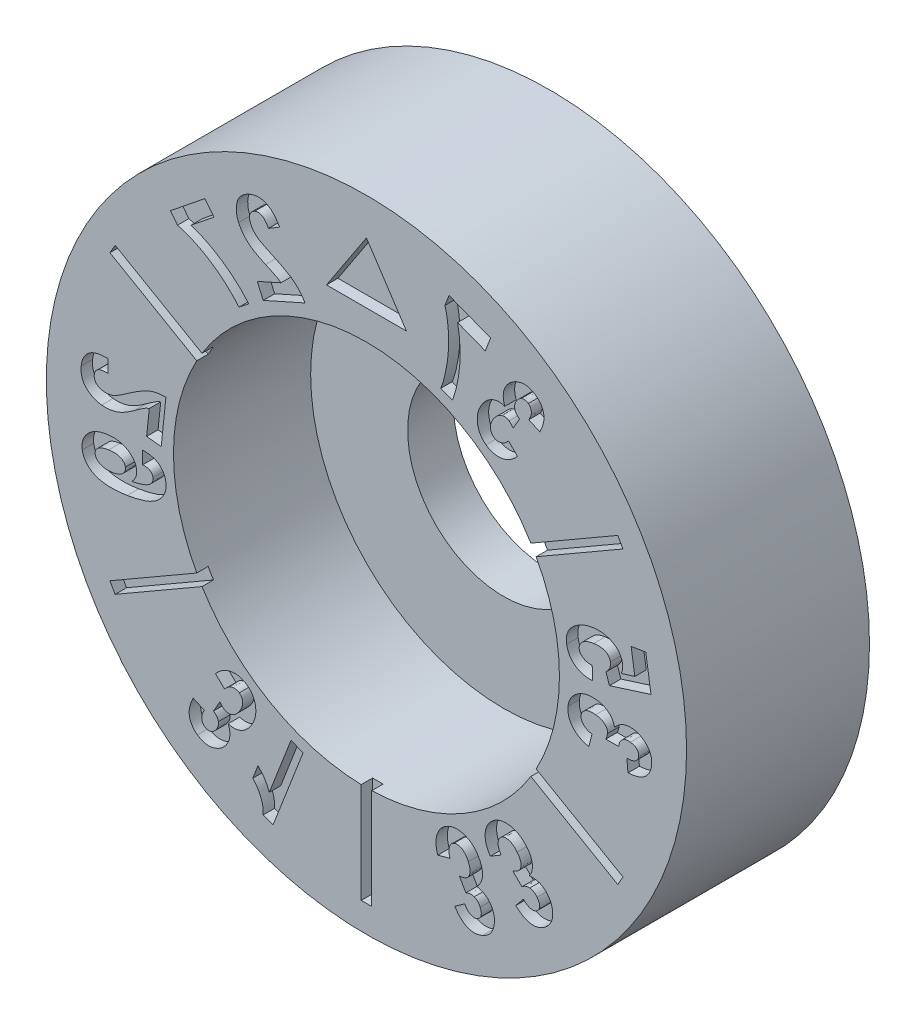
from build123d import *
from build123d.topology import SkipClean

# Parameters (mm, degrees)
SKETCH4_R           = 7
BOSS_EXTRUDE2_DEPTH = 4
SKETCH5_R           = 4.22
CUT_EXTRUDE2_DEPTH  = 3
SKETCH6_R           = 2.1
CUT_EXTRUDE3_DEPTH  = 11.344080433
SKETCH2_W           = 0.23
SKETCH2_H           = 3.311361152
CUT_EXTRUDE1_DEPTH  = 0.25
CUT_EXTRUDE4_DEPTH  = 0.25


with BuildPart() as part:
    # Sketch4 → Boss-Extrude2 (new body)
    with BuildSketch(Plane.XY):
        Circle(SKETCH4_R)
    extrude(amount=-BOSS_EXTRUDE2_DEPTH)

    # Sketch5 → Cut-Extrude2 (cut)
    with BuildSketch(Plane.XY):
        Circle(SKETCH5_R)
    extrude(amount=-CUT_EXTRUDE2_DEPTH, mode=Mode.SUBTRACT)

    # Sketch6 → Cut-Extrude3 (cut, through all)
    with BuildSketch(Plane.XY.offset(-3)):
        Circle(SKETCH6_R)
    extrude(amount=-CUT_EXTRUDE3_DEPTH, mode=Mode.SUBTRACT)

    # Sketch2 → Cut-Extrude1 (cut)
    # profile 1 of 17: a face of its own
    with BuildSketch(Plane.XY):
        with Locations((0, -4.755680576)):
            Rectangle(SKETCH2_W, SKETCH2_H)
    # profile 2 of 17: a face of its own
    with BuildSketch(Plane.XY):
        Polygon((-2.627178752, -1.649592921), (-5.494901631, -3.305273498), (-5.609901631, -3.106087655), (-2.742178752, -1.450407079), align=None)
    # profile 3 of 17: a face of its own
    with BuildSketch(Plane.XY):
        Polygon((-2.742178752, 1.450407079), (-5.609901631, 3.106087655), (-5.494901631, 3.305273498), (-2.627178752, 1.649592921), align=None)
    # profile 4 of 17: a face of its own
    with BuildSketch(Plane.XY):
        Polygon((2.627178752, 1.649592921), (5.494901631, 3.305273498), (5.609901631, 3.106087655), (2.742178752, 1.450407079), align=None)
    # profile 5 of 17: a face of its own
    with BuildSketch(Plane.XY):
        Polygon((2.742178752, -1.450407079), (5.609901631, -3.106087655), (5.494901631, -3.305273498), (2.627178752, -1.649592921), align=None)
    # profile 6 of 17: a face of its own
    with BuildSketch(Plane.XY):
        with BuildLine():
            Line((-2.38861569, 4.17471907), (-2.256937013, 3.880199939))
            Line((-2.256937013, 3.880199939), (-1.344315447, 4.287917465))
            add(Edge.make_bspline(
                [(-1.344315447, 4.287917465), (-1.35986274, 4.314109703), (-1.390802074, 4.366232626), (-1.446032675, 4.438548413), (-1.507471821, 4.505505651), (-1.56439157, 4.557424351), (-1.615671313, 4.596737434), (-1.659918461, 4.62755868), (-1.710098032, 4.659193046), (-1.766149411, 4.691687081), (-1.827747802, 4.72533601), (-1.894948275, 4.76007545), (-1.967894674, 4.795711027), (-2.01885546, 4.81896875), (-2.04516792, 4.830977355)],
                knots=[0, 0, 0, 0, 1.212157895, 2.412211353, 3.615463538, 4.827631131, 5.474319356, 6.187579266, 6.974328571, 7.83585823, 8.767313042, 9.769280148, 10.848217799, 12, 12, 12, 12], degree=3))
            add(Edge.make_bspline(
                [(-2.04516792, 4.830977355), (-2.065792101, 4.840420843), (-2.10512067, 4.858428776), (-2.160967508, 4.885057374), (-2.210959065, 4.909340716), (-2.25510831, 4.931547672), (-2.293110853, 4.952001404), (-2.325378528, 4.970194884), (-2.352057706, 4.985772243), (-2.367240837, 4.996392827), (-2.373987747, 5.001112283)],
                knots=[0, 0, 0, 0, 1.468863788, 2.80099903, 4.006361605, 5.067811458, 6.000988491, 6.800569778, 7.467010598, 8, 8, 8, 8], degree=3))
            add(Edge.make_bspline(
                [(-2.373987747, 5.001112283), (-2.390475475, 5.013720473), (-2.422592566, 5.038280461), (-2.463775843, 5.081130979), (-2.498548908, 5.12672587), (-2.515139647, 5.16034811), (-2.523354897, 5.176996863)],
                knots=[0, 0, 0, 0, 1.065813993, 2.076140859, 3.047360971, 4, 4, 4, 4], degree=3))
            add(Edge.make_bspline(
                [(-2.523354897, 5.176996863), (-2.530518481, 5.194214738), (-2.544024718, 5.226677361), (-2.555050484, 5.275673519), (-2.556791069, 5.320936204), (-2.549509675, 5.362170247), (-2.53375294, 5.398548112), (-2.51107434, 5.430102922), (-2.481096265, 5.45639438), (-2.457036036, 5.468367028), (-2.444654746, 5.474528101)],
                knots=[0, 0, 0, 0, 1.284158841, 2.421156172, 3.44251606, 4.388532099, 5.283236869, 6.152893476, 7.049486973, 8, 8, 8, 8], degree=3))
            add(Edge.make_bspline(
                [(-2.444654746, 5.474528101), (-2.430613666, 5.479930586), (-2.403743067, 5.490269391), (-2.361262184, 5.494591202), (-2.320318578, 5.487543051), (-2.28101305, 5.46992937), (-2.243360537, 5.442106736), (-2.207834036, 5.403757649), (-2.173236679, 5.355768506), (-2.15348389, 5.318914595), (-2.14297927, 5.299315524)],
                knots=[0, 0, 0, 0, 0.920150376, 1.760903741, 2.583707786, 3.441287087, 4.380171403, 5.436752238, 6.636853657, 8, 8, 8, 8], degree=3))
            Line((-2.14297927, 5.299315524), (-1.898431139, 5.446418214))
            add(Edge.make_bspline(
                [(-1.898431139, 5.446418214), (-1.90988274, 5.465824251), (-1.932050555, 5.503390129), (-1.967411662, 5.556216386), (-2.004317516, 5.603050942), (-2.042087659, 5.644678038), (-2.081030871, 5.680694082), (-2.120866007, 5.711533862), (-2.16227274, 5.736016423), (-2.204221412, 5.755945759), (-2.24760074, 5.769600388), (-2.29137052, 5.779847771), (-2.336113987, 5.784331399), (-2.381503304, 5.783803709), (-2.42762579, 5.779127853), (-2.474533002, 5.769124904), (-2.522108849, 5.754429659), (-2.55338014, 5.741404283), (-2.569320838, 5.734764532)],
                knots=[0, 0, 0, 0, 1.321428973, 2.557999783, 3.724920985, 4.815590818, 5.851101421, 6.83253569, 7.763825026, 8.667351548, 9.549721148, 10.425710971, 11.299836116, 12.179340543, 13.084305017, 14.014087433, 14.987671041, 16, 16, 16, 16], degree=3))
            add(Edge.make_bspline(
                [(-2.569320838, 5.734764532), (-2.586383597, 5.726700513), (-2.619624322, 5.710990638), (-2.665159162, 5.682317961), (-2.706176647, 5.651694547), (-2.741248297, 5.617236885), (-2.771828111, 5.580503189), (-2.796267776, 5.540197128), (-2.816078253, 5.497499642), (-2.829873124, 5.452131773), (-2.839235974, 5.405723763), (-2.845218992, 5.359168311), (-2.846917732, 5.312843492), (-2.84426771, 5.266789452), (-2.838344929, 5.220880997), (-2.82801476, 5.17523172), (-2.813663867, 5.129839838), (-2.801392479, 5.100274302), (-2.795190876, 5.08533274)],
                knots=[0, 0, 0, 0, 1.169979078, 2.279288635, 3.332734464, 4.339786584, 5.322922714, 6.290523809, 7.255851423, 8.23619719, 9.224803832, 10.190899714, 11.145586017, 12.096438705, 13.050227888, 14.014490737, 14.99658141, 16, 16, 16, 16], degree=3))
            add(Edge.make_bspline(
                [(-2.795190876, 5.08533274), (-2.787406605, 5.068645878), (-2.771935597, 5.035481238), (-2.744158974, 4.988199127), (-2.713687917, 4.942947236), (-2.67958726, 4.900102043), (-2.64213389, 4.859249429), (-2.60152951, 4.819568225), (-2.55658033, 4.781977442), (-2.516213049, 4.751839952), (-2.480971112, 4.727857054), (-2.450884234, 4.709493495), (-2.418041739, 4.689987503), (-2.381629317, 4.670554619), (-2.342510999, 4.64982221), (-2.29982828, 4.6288767), (-2.254040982, 4.607379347), (-2.222355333, 4.593044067), (-2.206076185, 4.585679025)],
                knots=[0, 0, 0, 0, 1.114912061, 2.215854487, 3.317809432, 4.417614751, 5.529497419, 6.673597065, 7.854295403, 9.076315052, 9.724081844, 10.43590995, 11.211242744, 12.037756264, 12.935783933, 13.893213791, 14.917595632, 16, 16, 16, 16], degree=3))
            add(Edge.make_bspline(
                [(-2.206076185, 4.585679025), (-2.191041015, 4.578929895), (-2.16240862, 4.566077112), (-2.121703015, 4.547207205), (-2.085332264, 4.530059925), (-2.052847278, 4.514951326), (-2.024791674, 4.501278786), (-2.00065839, 4.489568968), (-1.98077449, 4.479719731), (-1.951924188, 4.463789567), (-1.914804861, 4.440739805), (-1.885394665, 4.417103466), (-1.87130059, 4.405776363)],
                knots=[0, 0, 0, 0, 1.296655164, 2.469299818, 3.529977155, 4.460362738, 5.288024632, 5.985415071, 6.571013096, 7.033411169, 8.57833912, 10, 10, 10, 10], degree=3))
            Line((-1.87130059, 4.405776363), (-2.38861569, 4.17471907))
        make_face()
    # profile 7 of 17: a face of its own
    with BuildSketch(Plane.XY):
        with BuildLine():
            Line((-3.332596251, 4.918874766), (-3.533646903, 5.169244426))
            Line((-3.533646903, 5.169244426), (-4.289423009, 4.561884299))
            Line((-4.289423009, 4.561884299), (-4.132092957, 4.366027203))
            add(Edge.make_bspline(
                [(-4.132092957, 4.366027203), (-4.116379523, 4.362628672), (-4.083973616, 4.355619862), (-4.034642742, 4.341248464), (-3.982508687, 4.325176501), (-3.928061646, 4.305595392), (-3.871445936, 4.282752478), (-3.81199298, 4.257879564), (-3.75033837, 4.229515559), (-3.664387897, 4.18822139), (-3.556323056, 4.130900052), (-3.429402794, 4.053214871), (-3.304553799, 3.96803859), (-3.183764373, 3.875922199), (-3.069580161, 3.779835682), (-2.96487646, 3.682654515), (-2.870126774, 3.586400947), (-2.813951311, 3.519464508), (-2.786657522, 3.486942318)],
                knots=[0, 0, 0, 0, 0.472620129, 0.974687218, 1.510186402, 2.076844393, 2.675459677, 3.30536778, 3.971784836, 4.670871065, 6.10941119, 7.566614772, 9.044589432, 10.551968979, 12.031742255, 13.431165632, 14.751888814, 16, 16, 16, 16], degree=3))
            Line((-2.786657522, 3.486942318), (-2.573909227, 3.658130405))
            add(Edge.make_bspline(
                [(-2.573909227, 3.658130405), (-2.594848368, 3.682395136), (-2.636683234, 3.730874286), (-2.702786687, 3.800738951), (-2.77125357, 3.868632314), (-2.842481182, 3.934433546), (-2.916214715, 3.99816865), (-2.992685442, 4.059566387), (-3.071694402, 4.11885205), (-3.152973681, 4.175971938), (-3.236130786, 4.229916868), (-3.320019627, 4.281007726), (-3.404255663, 4.328972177), (-3.489551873, 4.372465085), (-3.574745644, 4.413707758), (-3.66096493, 4.450786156), (-3.747518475, 4.485160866), (-3.806086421, 4.50504954), (-3.835233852, 4.514947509)],
                knots=[0, 0, 0, 0, 0.996728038, 1.991389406, 2.990488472, 3.995219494, 5.006756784, 6.021174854, 7.04473312, 8.078530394, 9.1103283, 10.127033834, 11.133212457, 12.124299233, 13.10437921, 14.07652616, 15.042747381, 16, 16, 16, 16], degree=3))
            Line((-3.835233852, 4.514947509), (-3.332596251, 4.918874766))
        make_face()
    # profile 8 of 17: a face of its own
    with BuildSketch(Plane.XY):
        with BuildLine():
            Line((-4.806768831, 0.028828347), (-4.487853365, -0.004358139))
            Line((-4.487853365, -0.004358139), (-4.384871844, 0.982652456))
            add(Edge.make_bspline(
                [(-4.384871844, 0.982652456), (-4.415096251, 0.982269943), (-4.475329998, 0.981507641), (-4.565005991, 0.970263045), (-4.653197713, 0.950528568), (-4.726183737, 0.927401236), (-4.785405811, 0.902403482), (-4.83404411, 0.879929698), (-4.885881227, 0.852224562), (-4.941767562, 0.820644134), (-5.001024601, 0.784257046), (-5.064342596, 0.74388267), (-5.13083082, 0.69845152), (-5.17630209, 0.666543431), (-5.199782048, 0.650067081)],
                knots=[0, 0, 0, 0, 1.211869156, 2.415114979, 3.617279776, 4.833766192, 5.480004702, 6.195062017, 6.982399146, 7.837034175, 8.769941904, 9.771538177, 10.849291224, 12, 12, 12, 12], degree=3))
            add(Edge.make_bspline(
                [(-5.199782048, 0.650067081), (-5.218189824, 0.637002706), (-5.25331231, 0.612075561), (-5.303939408, 0.577161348), (-5.35007064, 0.546858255), (-5.390891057, 0.51961191), (-5.427279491, 0.496897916), (-5.459002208, 0.478074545), (-5.485774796, 0.463072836), (-5.50246253, 0.455233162), (-5.509848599, 0.451763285)],
                knots=[0, 0, 0, 0, 1.470364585, 2.805491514, 4.0056549, 5.065580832, 6.002267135, 6.799313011, 7.468570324, 8, 8, 8, 8], degree=3))
            add(Edge.make_bspline(
                [(-5.509848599, 0.451763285), (-5.528789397, 0.443858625), (-5.565642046, 0.428478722), (-5.622810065, 0.41424676), (-5.679342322, 0.407738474), (-5.716602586, 0.409896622), (-5.735037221, 0.410964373)],
                knots=[0, 0, 0, 0, 1.062812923, 2.067889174, 3.044082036, 4, 4, 4, 4], degree=3))
            add(Edge.make_bspline(
                [(-5.735037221, 0.410964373), (-5.753424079, 0.413422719), (-5.787958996, 0.418040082), (-5.835627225, 0.432806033), (-5.875472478, 0.453662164), (-5.907303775, 0.480556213), (-5.931110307, 0.512006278), (-5.946401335, 0.547482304), (-5.954073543, 0.586182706), (-5.952632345, 0.61270944), (-5.951888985, 0.626391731)],
                knots=[0, 0, 0, 0, 1.286685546, 2.416703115, 3.446991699, 4.38911374, 5.28800676, 6.160909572, 7.051410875, 8, 8, 8, 8], degree=3))
            add(Edge.make_bspline(
                [(-5.951888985, 0.626391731), (-5.949655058, 0.641143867), (-5.94537349, 0.669417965), (-5.927387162, 0.707731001), (-5.901458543, 0.739750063), (-5.86664567, 0.76462232), (-5.823984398, 0.783100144), (-5.773339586, 0.79475191), (-5.714765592, 0.800764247), (-5.673191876, 0.799385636), (-5.651071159, 0.798652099)],
                knots=[0, 0, 0, 0, 0.917495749, 1.758481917, 2.579149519, 3.436617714, 4.373781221, 5.43330302, 6.634301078, 8, 8, 8, 8], degree=3))
            Line((-5.651071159, 0.798652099), (-5.65647275, 1.08168275))
            add(Edge.make_bspline(
                [(-5.65647275, 1.08168275), (-5.678837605, 1.08159366), (-5.722130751, 1.081421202), (-5.784952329, 1.076600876), (-5.843565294, 1.068818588), (-5.8979602, 1.05654583), (-5.948341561, 1.041339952), (-5.994628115, 1.02223826), (-6.036618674, 0.999418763), (-6.074300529, 0.972661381), (-6.108015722, 0.942709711), (-6.137861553, 0.909685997), (-6.163973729, 0.873646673), (-6.18646179, 0.834633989), (-6.205093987, 0.792391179), (-6.219792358, 0.747234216), (-6.230743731, 0.699063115), (-6.235048, 0.665807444), (-6.237256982, 0.648740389)],
                knots=[0, 0, 0, 0, 1.321555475, 2.558223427, 3.721519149, 4.813249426, 5.850562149, 6.828694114, 7.767736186, 8.669154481, 9.554368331, 10.428276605, 11.294894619, 12.180196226, 13.084940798, 14.018756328, 14.983211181, 16, 16, 16, 16], degree=3))
            add(Edge.make_bspline(
                [(-6.237256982, 0.648740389), (-6.238865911, 0.630094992), (-6.242006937, 0.593694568), (-6.239993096, 0.540310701), (-6.233534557, 0.489837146), (-6.22206181, 0.442381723), (-6.204968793, 0.398176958), (-6.183329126, 0.356795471), (-6.155945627, 0.318903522), (-6.124055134, 0.284192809), (-6.088570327, 0.253293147), (-6.051461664, 0.225028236), (-6.012545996, 0.200247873), (-5.971638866, 0.179202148), (-5.928883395, 0.162028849), (-5.88450852, 0.148189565), (-5.838560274, 0.137442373), (-5.807080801, 0.13358379), (-5.791202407, 0.131637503)],
                knots=[0, 0, 0, 0, 1.16814542, 2.280508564, 3.329352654, 4.343081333, 5.32197149, 6.283149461, 7.252179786, 8.233607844, 9.221352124, 10.187662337, 11.145524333, 12.099452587, 13.057314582, 14.019996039, 15.001276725, 16, 16, 16, 16], degree=3))
            add(Edge.make_bspline(
                [(-5.791202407, 0.131637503), (-5.772938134, 0.130104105), (-5.736676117, 0.127059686), (-5.682242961, 0.12739451), (-5.628373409, 0.131168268), (-5.574753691, 0.13917772), (-5.521012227, 0.15058813), (-5.466764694, 0.166048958), (-5.412191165, 0.186069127), (-5.366190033, 0.205817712), (-5.328228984, 0.224583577), (-5.297148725, 0.24055172), (-5.264378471, 0.259731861), (-5.229240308, 0.280874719), (-5.192221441, 0.304982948), (-5.152638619, 0.330677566), (-5.1115858, 0.35960485), (-5.083459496, 0.37951015), (-5.068972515, 0.389762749)],
                knots=[0, 0, 0, 0, 1.11796755, 2.219620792, 3.317735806, 4.410812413, 5.52502108, 6.668327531, 7.849651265, 9.070047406, 9.7210273, 10.433543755, 11.201719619, 12.037454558, 12.935835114, 13.897257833, 14.916943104, 16, 16, 16, 16], degree=3))
            add(Edge.make_bspline(
                [(-5.068972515, 0.389762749), (-5.055643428, 0.399269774), (-5.030178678, 0.417432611), (-4.993798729, 0.443138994), (-4.961322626, 0.466449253), (-4.931834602, 0.486195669), (-4.906345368, 0.503994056), (-4.884187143, 0.518566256), (-4.865867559, 0.530675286), (-4.838055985, 0.547576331), (-4.799841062, 0.567906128), (-4.765084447, 0.581557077), (-4.748446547, 0.588091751)],
                knots=[0, 0, 0, 0, 1.298948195, 2.481594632, 3.534292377, 4.470297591, 5.297044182, 6.000620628, 6.574384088, 7.039060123, 8.582605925, 10, 10, 10, 10], degree=3))
            Line((-4.748446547, 0.588091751), (-4.806768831, 0.028828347))
        make_face()
    # profile 9 of 17: a face of its own
    with BuildSketch(Plane.XY):
        with BuildLine():
            Line((-4.898305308, -0.272704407), (-4.892813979, -0.551067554))
            add(Edge.make_bspline(
                [(-4.892813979, -0.551067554), (-4.876900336, -0.550482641), (-4.846912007, -0.549380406), (-4.804530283, -0.553788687), (-4.767536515, -0.562088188), (-4.735977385, -0.575676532), (-4.710295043, -0.594598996), (-4.690062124, -0.618135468), (-4.675977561, -0.646736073), (-4.671511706, -0.667771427), (-4.669200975, -0.678655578)],
                knots=[0, 0, 0, 0, 1.331727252, 2.509562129, 3.556688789, 4.495461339, 5.364040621, 6.204594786, 7.071018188, 8, 8, 8, 8], degree=3))
            add(Edge.make_bspline(
                [(-4.669200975, -0.678655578), (-4.668337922, -0.686353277), (-4.666619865, -0.701676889), (-4.667709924, -0.724607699), (-4.672620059, -0.746855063), (-4.680117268, -0.768697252), (-4.692087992, -0.789458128), (-4.70592535, -0.810473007), (-4.72452583, -0.829586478), (-4.745352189, -0.849642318), (-4.772093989, -0.868315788), (-4.804834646, -0.886514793), (-4.843951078, -0.904528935), (-4.889740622, -0.92198017), (-4.942132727, -0.938583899), (-5.00094451, -0.955849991), (-5.066402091, -0.972304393), (-5.112485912, -0.982209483), (-5.136508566, -0.987372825)],
                knots=[0, 0, 0, 0, 0.605521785, 1.205396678, 1.785583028, 2.38386724, 3.003757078, 3.65547853, 4.346733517, 5.083986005, 5.915480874, 6.888923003, 8.012661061, 9.281992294, 10.720544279, 12.311947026, 14.077485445, 16, 16, 16, 16], degree=3))
            add(Edge.make_bspline(
                [(-5.136508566, -0.987372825), (-5.12604289, -0.976786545), (-5.105717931, -0.956227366), (-5.079491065, -0.922725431), (-5.058227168, -0.888149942), (-5.042001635, -0.852297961), (-5.03053855, -0.815620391), (-5.023753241, -0.77781112), (-5.022614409, -0.738791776), (-5.025775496, -0.712732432), (-5.027381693, -0.699491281)],
                knots=[0, 0, 0, 0, 1.112289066, 2.160130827, 3.173192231, 4.140090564, 5.094654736, 6.039270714, 7.003723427, 8, 8, 8, 8], degree=3))
            add(Edge.make_bspline(
                [(-5.027381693, -0.699491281), (-5.029921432, -0.685760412), (-5.034968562, -0.658473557), (-5.04921043, -0.619392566), (-5.068095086, -0.582398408), (-5.09093865, -0.546784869), (-5.119935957, -0.514160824), (-5.152866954, -0.482933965), (-5.190763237, -0.453769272), (-5.233061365, -0.426999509), (-5.279133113, -0.40330703), (-5.328271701, -0.384010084), (-5.380193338, -0.369167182), (-5.434770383, -0.359013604), (-5.491960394, -0.353343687), (-5.551759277, -0.352437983), (-5.614219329, -0.355627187), (-5.656520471, -0.361424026), (-5.678128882, -0.364385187)],
                knots=[0, 0, 0, 0, 0.825096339, 1.639683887, 2.449799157, 3.280068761, 4.135219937, 5.025284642, 5.962526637, 6.959655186, 7.983593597, 9.023226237, 10.078221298, 11.174116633, 12.3035961, 13.474587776, 14.709960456, 16, 16, 16, 16], degree=3))
            add(Edge.make_bspline(
                [(-5.678128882, -0.364385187), (-5.701081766, -0.368433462), (-5.745781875, -0.376317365), (-5.810312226, -0.392425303), (-5.870374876, -0.412410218), (-5.925703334, -0.436642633), (-5.976998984, -0.46371544), (-6.023583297, -0.495142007), (-6.066013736, -0.529979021), (-6.103644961, -0.568332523), (-6.136046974, -0.609210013), (-6.163526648, -0.651351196), (-6.18608755, -0.694552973), (-6.201874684, -0.739447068), (-6.213648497, -0.785224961), (-6.219292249, -0.832376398), (-6.219447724, -0.880711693), (-6.215610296, -0.912915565), (-6.213664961, -0.929240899)],
                knots=[0, 0, 0, 0, 1.283957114, 2.500471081, 3.661249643, 4.767370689, 5.82526176, 6.852765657, 7.858107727, 8.845471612, 9.807438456, 10.727410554, 11.61450693, 12.485346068, 13.343691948, 14.214272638, 15.0947488, 16, 16, 16, 16], degree=3))
            add(Edge.make_bspline(
                [(-6.213664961, -0.929240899), (-6.210248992, -0.947286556), (-6.203520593, -0.982830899), (-6.185247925, -1.033523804), (-6.161030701, -1.080859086), (-6.130510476, -1.124595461), (-6.093990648, -1.165100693), (-6.051111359, -1.201641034), (-6.002078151, -1.234798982), (-5.94697, -1.264702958), (-5.884412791, -1.289617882), (-5.814200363, -1.308804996), (-5.735971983, -1.321703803), (-5.65004688, -1.329093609), (-5.556303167, -1.330752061), (-5.454788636, -1.326303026), (-5.345335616, -1.316022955), (-5.270021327, -1.305291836), (-5.230978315, -1.299728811)],
                knots=[0, 0, 0, 0, 0.750958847, 1.479155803, 2.197025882, 2.922299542, 3.656206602, 4.423951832, 5.222706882, 6.075809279, 6.985942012, 7.973119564, 9.049924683, 10.227471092, 11.501144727, 12.885724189, 14.385555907, 16, 16, 16, 16], degree=3))
            add(Edge.make_bspline(
                [(-5.230978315, -1.299728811), (-5.191335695, -1.293186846), (-5.114904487, -1.280573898), (-5.005607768, -1.256151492), (-4.905539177, -1.228927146), (-4.81469014, -1.198542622), (-4.733171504, -1.16457692), (-4.661234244, -1.126936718), (-4.598290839, -1.086262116), (-4.54504501, -1.041562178), (-4.500062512, -0.994441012), (-4.462327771, -0.945631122), (-4.431602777, -0.895086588), (-4.40780892, -0.842874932), (-4.391641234, -0.788642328), (-4.383549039, -0.732601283), (-4.381214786, -0.674809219), (-4.386043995, -0.636153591), (-4.388501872, -0.616479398)],
                knots=[0, 0, 0, 0, 1.587762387, 3.061215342, 4.4240891, 5.685108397, 6.844872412, 7.910581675, 8.890199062, 9.800819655, 10.651499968, 11.460460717, 12.234562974, 12.98427444, 13.722359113, 14.462683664, 15.217566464, 16, 16, 16, 16], degree=3))
            add(Edge.make_bspline(
                [(-4.388501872, -0.616479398), (-4.391022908, -0.60299451), (-4.395962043, -0.57657535), (-4.40678948, -0.53830941), (-4.421240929, -0.502587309), (-4.438767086, -0.469115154), (-4.459368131, -0.438010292), (-4.483160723, -0.409127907), (-4.510401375, -0.383033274), (-4.54034775, -0.35881902), (-4.573685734, -0.337519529), (-4.610370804, -0.319176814), (-4.650316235, -0.303813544), (-4.693521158, -0.29150128), (-4.740003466, -0.281885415), (-4.789868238, -0.276329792), (-4.842970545, -0.272437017), (-4.879470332, -0.272613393), (-4.898305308, -0.272704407)],
                knots=[0, 0, 0, 0, 0.96627953, 1.893103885, 2.796446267, 3.676516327, 4.550839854, 5.420606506, 6.307216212, 7.204181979, 8.130092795, 9.088572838, 10.089345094, 11.140960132, 12.250794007, 13.429317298, 14.673451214, 16, 16, 16, 16], degree=3))
        make_face()
        with BuildLine():
            add(Edge.make_bspline(
                [(-5.549828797, -1.026457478), (-5.563431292, -1.028350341), (-5.58990614, -1.032034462), (-5.628857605, -1.03526752), (-5.665750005, -1.035828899), (-5.700535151, -1.034405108), (-5.733082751, -1.029976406), (-5.763688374, -1.023667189), (-5.792206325, -1.014749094), (-5.81832474, -1.003458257), (-5.842003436, -0.990697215), (-5.862807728, -0.976625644), (-5.88128565, -0.962038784), (-5.896682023, -0.945973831), (-5.909892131, -0.929308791), (-5.919691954, -0.911190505), (-5.927585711, -0.892531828), (-5.92999435, -0.879270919), (-5.931199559, -0.872635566)],
                knots=[0, 0, 0, 0, 1.454681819, 2.831280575, 4.137058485, 5.361307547, 6.515260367, 7.612689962, 8.668242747, 9.674086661, 10.622736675, 11.513041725, 12.332214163, 13.110889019, 13.865699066, 14.576470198, 15.28770925, 16, 16, 16, 16], degree=3))
            add(Edge.make_bspline(
                [(-5.931199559, -0.872635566), (-5.932261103, -0.859814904), (-5.934346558, -0.834628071), (-5.925004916, -0.796881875), (-5.905705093, -0.761625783), (-5.882094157, -0.734894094), (-5.858578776, -0.714506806), (-5.836164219, -0.701181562), (-5.811427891, -0.687523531), (-5.782754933, -0.676252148), (-5.751211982, -0.6651669), (-5.715884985, -0.656495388), (-5.677671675, -0.647349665), (-5.650774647, -0.643148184), (-5.636800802, -0.640965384)],
                knots=[0, 0, 0, 0, 1.102291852, 2.165507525, 3.293065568, 4.536244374, 5.218090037, 5.966118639, 6.776767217, 7.650522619, 8.615824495, 9.655651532, 10.782037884, 12, 12, 12, 12], degree=3))
            add(Edge.make_bspline(
                [(-5.636800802, -0.640965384), (-5.622851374, -0.638950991), (-5.595803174, -0.635045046), (-5.556304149, -0.631681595), (-5.519408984, -0.630683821), (-5.485184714, -0.631798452), (-5.453440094, -0.634427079), (-5.424417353, -0.640314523), (-5.398002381, -0.647937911), (-5.367354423, -0.660853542), (-5.33439775, -0.680751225), (-5.302920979, -0.710698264), (-5.280729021, -0.746098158), (-5.274718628, -0.772508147), (-5.271700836, -0.785768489)],
                knots=[0, 0, 0, 0, 1.160909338, 2.251024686, 3.263680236, 4.199506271, 5.071386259, 5.883896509, 6.635025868, 7.332397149, 8.619435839, 9.781774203, 10.886238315, 12, 12, 12, 12], degree=3))
            add(Edge.make_bspline(
                [(-5.271700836, -0.785768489), (-5.270690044, -0.798860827), (-5.268682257, -0.824866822), (-5.278336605, -0.864058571), (-5.297983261, -0.901356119), (-5.322344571, -0.92968308), (-5.345916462, -0.951446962), (-5.367240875, -0.966392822), (-5.39108942, -0.980137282), (-5.41763559, -0.992282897), (-5.446882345, -1.003058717), (-5.478783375, -1.012166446), (-5.513238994, -1.020649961), (-5.537323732, -1.02447268), (-5.549828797, -1.026457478)],
                knots=[0, 0, 0, 0, 1.149368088, 2.283049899, 3.495169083, 4.829618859, 5.548716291, 6.314428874, 7.115095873, 7.968233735, 8.879907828, 9.855091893, 10.886339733, 12, 12, 12, 12], degree=3))
        make_face(mode=Mode.SUBTRACT)
    # profile 10 of 17: a face of its own
    with BuildSketch(Plane.XY):
        with BuildLine():
            Line((-3.301512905, -3.709615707), (-3.10332072, -3.902797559))
            add(Edge.make_bspline(
                [(-3.10332072, -3.902797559), (-3.089537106, -3.888010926), (-3.063397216, -3.859968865), (-3.020939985, -3.824896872), (-2.977202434, -3.800447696), (-2.933612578, -3.785273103), (-2.891236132, -3.778854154), (-2.851057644, -3.78144144), (-2.813174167, -3.792025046), (-2.791372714, -3.805881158), (-2.780338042, -3.812894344)],
                knots=[0, 0, 0, 0, 1.313315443, 2.490632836, 3.563135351, 4.552527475, 5.476312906, 6.328690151, 7.154076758, 8, 8, 8, 8], degree=3))
            add(Edge.make_bspline(
                [(-2.780338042, -3.812894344), (-2.769512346, -3.821970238), (-2.748113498, -3.839910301), (-2.725120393, -3.876067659), (-2.711539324, -3.918138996), (-2.706381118, -3.965228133), (-2.710788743, -4.016243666), (-2.726286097, -4.069473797), (-2.752438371, -4.124400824), (-2.776320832, -4.159483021), (-2.788897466, -4.177957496)],
                knots=[0, 0, 0, 0, 0.830652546, 1.64192741, 2.490693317, 3.423109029, 4.422347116, 5.495599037, 6.681168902, 8, 8, 8, 8], degree=3))
            add(Edge.make_bspline(
                [(-2.788897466, -4.177957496), (-2.801525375, -4.194402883), (-2.825616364, -4.225776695), (-2.867232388, -4.264456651), (-2.910284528, -4.294097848), (-2.955046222, -4.312442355), (-2.998996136, -4.321352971), (-3.040683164, -4.32045794), (-3.079996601, -4.310823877), (-3.102361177, -4.296692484), (-3.113642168, -4.28956442)],
                knots=[0, 0, 0, 0, 1.300088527, 2.480253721, 3.552556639, 4.564702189, 5.496932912, 6.34813385, 7.166776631, 8, 8, 8, 8], degree=3))
            add(Edge.make_bspline(
                [(-3.113642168, -4.28956442), (-3.121103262, -4.28378975), (-3.13688589, -4.271574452), (-3.158675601, -4.24880908), (-3.181717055, -4.222954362), (-3.195758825, -4.203341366), (-3.203094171, -4.193095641)],
                knots=[0, 0, 0, 0, 0.855950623, 1.810612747, 2.856275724, 4, 4, 4, 4], degree=3))
            Line((-3.203094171, -4.193095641), (-3.343113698, -4.438885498))
            add(Edge.make_bspline(
                [(-3.343113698, -4.438885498), (-3.32930971, -4.449302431), (-3.302896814, -4.469234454), (-3.271047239, -4.505277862), (-3.248424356, -4.544942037), (-3.241280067, -4.57355055), (-3.237725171, -4.587785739)],
                knots=[0, 0, 0, 0, 1.106371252, 2.116958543, 3.063025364, 4, 4, 4, 4], degree=3))
            add(Edge.make_bspline(
                [(-3.237725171, -4.587785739), (-3.236287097, -4.602281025), (-3.233374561, -4.631638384), (-3.241947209, -4.676730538), (-3.26001013, -4.722151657), (-3.278812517, -4.750228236), (-3.288692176, -4.764980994)],
                knots=[0, 0, 0, 0, 0.91965131, 1.862573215, 2.876895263, 4, 4, 4, 4], degree=3))
            add(Edge.make_bspline(
                [(-3.288692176, -4.764980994), (-3.297694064, -4.776664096), (-3.314827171, -4.798900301), (-3.344968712, -4.826013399), (-3.376897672, -4.845604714), (-3.410093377, -4.857787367), (-3.443698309, -4.862211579), (-3.476461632, -4.859059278), (-3.508311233, -4.84922339), (-3.526976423, -4.837034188), (-3.536549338, -4.830782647)],
                knots=[0, 0, 0, 0, 1.226264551, 2.333924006, 3.354501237, 4.328279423, 5.256886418, 6.151497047, 7.051948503, 8, 8, 8, 8], degree=3))
            add(Edge.make_bspline(
                [(-3.536549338, -4.830782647), (-3.545483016, -4.823452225), (-3.563298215, -4.808834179), (-3.583013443, -4.779754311), (-3.59614941, -4.746179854), (-3.602480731, -4.708235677), (-3.601314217, -4.666357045), (-3.590910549, -4.621679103), (-3.572253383, -4.574368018), (-3.554617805, -4.543452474), (-3.545263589, -4.527054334)],
                knots=[0, 0, 0, 0, 0.823211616, 1.641617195, 2.479398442, 3.385980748, 4.374965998, 5.456466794, 6.650865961, 8, 8, 8, 8], degree=3))
            Line((-3.545263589, -4.527054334), (-3.788717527, -4.417775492))
            add(Edge.make_bspline(
                [(-3.788717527, -4.417775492), (-3.797568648, -4.435983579), (-3.814695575, -4.471216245), (-3.836033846, -4.524141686), (-3.85295353, -4.574955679), (-3.865759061, -4.623804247), (-3.87402163, -4.670800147), (-3.877985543, -4.715856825), (-3.877158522, -4.759002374), (-3.87184857, -4.800181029), (-3.862504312, -4.839509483), (-3.84936144, -4.877017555), (-3.833314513, -4.913064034), (-3.812665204, -4.946882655), (-3.789073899, -4.979392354), (-3.761668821, -5.010065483), (-3.730615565, -5.03904969), (-3.707706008, -5.056389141), (-3.696014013, -5.065238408)],
                knots=[0, 0, 0, 0, 1.342567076, 2.597868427, 3.781833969, 4.893025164, 5.944319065, 6.943251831, 7.888510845, 8.800836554, 9.692153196, 10.564499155, 11.434036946, 12.303874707, 13.187511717, 14.095250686, 15.027902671, 16, 16, 16, 16], degree=3))
            add(Edge.make_bspline(
                [(-3.696014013, -5.065238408), (-3.682512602, -5.074523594), (-3.656088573, -5.09269592), (-3.61415107, -5.114339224), (-3.571985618, -5.131406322), (-3.529063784, -5.142829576), (-3.485625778, -5.149810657), (-3.441577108, -5.150535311), (-3.397050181, -5.14720516), (-3.352783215, -5.137625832), (-3.309363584, -5.124634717), (-3.267814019, -5.108532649), (-3.228829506, -5.089106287), (-3.192043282, -5.067288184), (-3.157758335, -5.04222124), (-3.126018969, -5.013988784), (-3.096493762, -4.983081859), (-3.079143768, -4.960332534), (-3.070455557, -4.948940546)],
                knots=[0, 0, 0, 0, 1.108032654, 2.168565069, 3.186696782, 4.180904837, 5.16853456, 6.156301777, 7.155652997, 8.183938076, 9.214268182, 10.221234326, 11.195469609, 12.158982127, 13.112719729, 14.064889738, 15.030971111, 16, 16, 16, 16], degree=3))
            add(Edge.make_bspline(
                [(-3.070455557, -4.948940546), (-3.059687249, -4.933012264), (-3.038538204, -4.901728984), (-3.014432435, -4.851190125), (-2.997623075, -4.799163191), (-2.987846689, -4.745500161), (-2.985709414, -4.690269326), (-2.989746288, -4.633407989), (-3.001501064, -4.575135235), (-3.014413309, -4.536786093), (-3.02102289, -4.517155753)],
                knots=[0, 0, 0, 0, 1.015312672, 1.994082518, 2.948074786, 3.898390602, 4.867911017, 5.862301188, 6.905744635, 8, 8, 8, 8], degree=3))
            add(Edge.make_bspline(
                [(-3.02102289, -4.517155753), (-3.011019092, -4.520738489), (-2.991335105, -4.527788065), (-2.960838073, -4.534780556), (-2.930155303, -4.539647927), (-2.89899701, -4.540772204), (-2.867576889, -4.539529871), (-2.835880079, -4.535425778), (-2.804008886, -4.52780985), (-2.771813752, -4.518291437), (-2.739907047, -4.50564178), (-2.708918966, -4.489619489), (-2.678780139, -4.470939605), (-2.649593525, -4.449424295), (-2.621358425, -4.42525874), (-2.594180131, -4.398087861), (-2.567901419, -4.368073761), (-2.551554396, -4.346365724), (-2.54322329, -4.335302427)],
                knots=[0, 0, 0, 0, 0.923828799, 1.817773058, 2.717973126, 3.623146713, 4.52540168, 5.452141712, 6.398831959, 7.373733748, 8.37162039, 9.380079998, 10.405317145, 11.453934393, 12.532104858, 13.636044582, 14.795232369, 16, 16, 16, 16], degree=3))
            add(Edge.make_bspline(
                [(-2.54322329, -4.335302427), (-2.531718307, -4.318784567), (-2.509079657, -4.286281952), (-2.480954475, -4.235094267), (-2.45791145, -4.183448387), (-2.439616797, -4.131633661), (-2.427413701, -4.078927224), (-2.419984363, -4.025939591), (-2.418173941, -3.972263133), (-2.421668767, -3.918804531), (-2.429266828, -3.866423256), (-2.442279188, -3.816602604), (-2.45870771, -3.769522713), (-2.480580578, -3.725984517), (-2.505950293, -3.684998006), (-2.53664994, -3.64772248), (-2.570799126, -3.612570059), (-2.597013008, -3.592713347), (-2.610274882, -3.582667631)],
                knots=[0, 0, 0, 0, 1.147992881, 2.258934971, 3.326337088, 4.372639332, 5.388988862, 6.408160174, 7.421370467, 8.447574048, 9.461808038, 10.436460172, 11.381723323, 12.301363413, 13.211268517, 14.126067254, 15.051958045, 16, 16, 16, 16], degree=3))
            add(Edge.make_bspline(
                [(-2.610274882, -3.582667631), (-2.623324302, -3.573633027), (-2.649056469, -3.55581768), (-2.690187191, -3.534331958), (-2.732098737, -3.516884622), (-2.775154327, -3.504388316), (-2.819098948, -3.496298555), (-2.864014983, -3.492735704), (-2.909989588, -3.49391558), (-2.956637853, -3.499588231), (-3.003206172, -3.509834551), (-3.049160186, -3.524335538), (-3.094063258, -3.543665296), (-3.137927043, -3.567661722), (-3.180644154, -3.596295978), (-3.22221836, -3.629699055), (-3.26293234, -3.667499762), (-3.288479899, -3.695388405), (-3.301512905, -3.709615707)],
                knots=[0, 0, 0, 0, 0.978886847, 1.930268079, 2.857932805, 3.777218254, 4.69191487, 5.611691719, 6.553256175, 7.526036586, 8.507919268, 9.492473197, 10.496089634, 11.520538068, 12.574552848, 13.666158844, 14.809398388, 16, 16, 16, 16], degree=3))
        make_face()
    # profile 11 of 17: a face of its own
    with BuildSketch(Plane.XY):
        with BuildLine():
            Line((-1.384946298, -4.250590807), (-1.650206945, -4.147799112))
            Line((-1.650206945, -4.147799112), (-2.123963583, -5.36834973))
            add(Edge.make_bspline(
                [(-2.123963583, -5.36834973), (-2.13127495, -5.349922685), (-2.145750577, -5.31343935), (-2.170033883, -5.260210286), (-2.197538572, -5.209653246), (-2.227177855, -5.161001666), (-2.259578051, -5.114695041), (-2.294291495, -5.070460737), (-2.331879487, -5.028721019), (-2.358574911, -5.002568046), (-2.371984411, -4.989431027)],
                knots=[0, 0, 0, 0, 1.041213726, 2.061478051, 3.07069953, 4.062446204, 5.052273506, 6.037379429, 7.014147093, 8, 8, 8, 8], degree=3))
            Line((-2.371984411, -4.989431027), (-2.485876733, -5.283633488))
            add(Edge.make_bspline(
                [(-2.485876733, -5.283633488), (-2.47047667, -5.29952865), (-2.438413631, -5.332622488), (-2.395467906, -5.39098772), (-2.355693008, -5.458816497), (-2.318032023, -5.533645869), (-2.286292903, -5.613593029), (-2.265386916, -5.696467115), (-2.255193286, -5.780378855), (-2.257023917, -5.836311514), (-2.257941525, -5.864347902)],
                knots=[0, 0, 0, 0, 0.82685368, 1.721515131, 2.700916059, 3.764521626, 4.851755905, 5.909891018, 6.952327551, 8, 8, 8, 8], degree=3))
            Line((-2.257941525, -5.864347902), (-2.043469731, -5.947461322))
            Line((-2.043469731, -5.947461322), (-1.384946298, -4.250590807))
        make_face()
    # profile 12 of 17: a face of its own
    with BuildSketch(Plane.XY):
        with BuildLine():
            Line((1.559745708, -4.718155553), (1.828704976, -4.643377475))
            add(Edge.make_bspline(
                [(1.828704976, -4.643377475), (1.822583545, -4.623885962), (1.810985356, -4.586955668), (1.802572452, -4.532096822), (1.802066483, -4.481524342), (1.811664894, -4.435801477), (1.827755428, -4.395768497), (1.849871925, -4.361658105), (1.878618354, -4.334512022), (1.901522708, -4.322346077), (1.913056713, -4.316219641)],
                knots=[0, 0, 0, 0, 1.315585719, 2.492621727, 3.5656928, 4.557962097, 5.484188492, 6.333501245, 7.160796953, 8, 8, 8, 8], degree=3))
            add(Edge.make_bspline(
                [(1.913056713, -4.316219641), (1.926464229, -4.311311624), (1.952960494, -4.301612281), (1.996133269, -4.300281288), (2.03981511, -4.309008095), (2.075405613, -4.325159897), (2.103481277, -4.342534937), (2.123917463, -4.358806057), (2.144019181, -4.377070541), (2.162403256, -4.398562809), (2.180544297, -4.421987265), (2.196841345, -4.448509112), (2.21304238, -4.477013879), (2.222390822, -4.49738074), (2.227175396, -4.507804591)],
                knots=[0, 0, 0, 0, 1.248135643, 2.466596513, 3.738594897, 5.136390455, 5.875417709, 6.637189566, 7.429259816, 8.258976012, 9.119593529, 10.031081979, 10.992298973, 12, 12, 12, 12], degree=3))
            add(Edge.make_bspline(
                [(2.227175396, -4.507804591), (2.235136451, -4.527228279), (2.250267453, -4.564145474), (2.263237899, -4.619989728), (2.266977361, -4.672332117), (2.260776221, -4.72066106), (2.246094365, -4.763354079), (2.224460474, -4.799454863), (2.19625917, -4.829023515), (2.172520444, -4.841297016), (2.160545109, -4.847488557)],
                knots=[0, 0, 0, 0, 1.305880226, 2.481991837, 3.554566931, 4.557990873, 5.496064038, 6.345356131, 7.165291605, 8, 8, 8, 8], degree=3))
            add(Edge.make_bspline(
                [(2.160545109, -4.847488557), (2.15164768, -4.851074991), (2.132936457, -4.858617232), (2.102247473, -4.866520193), (2.068139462, -4.873162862), (2.044087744, -4.875487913), (2.031459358, -4.876708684)],
                knots=[0, 0, 0, 0, 0.865287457, 1.819692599, 2.855226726, 4, 4, 4, 4], degree=3))
            Line((2.031459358, -4.876708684), (2.174368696, -5.122982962))
            add(Edge.make_bspline(
                [(2.174368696, -5.122982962), (2.190398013, -5.116159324), (2.221101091, -5.103089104), (2.268774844, -5.094261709), (2.314938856, -5.093834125), (2.343619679, -5.102251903), (2.357909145, -5.106445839)],
                knots=[0, 0, 0, 0, 1.102626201, 2.112006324, 3.059356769, 4, 4, 4, 4], degree=3))
            add(Edge.make_bspline(
                [(2.357909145, -5.106445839), (2.371307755, -5.112477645), (2.398439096, -5.124691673), (2.433079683, -5.155258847), (2.463681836, -5.19357036), (2.478591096, -5.223979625), (2.486412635, -5.239932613)],
                knots=[0, 0, 0, 0, 0.922763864, 1.86853873, 2.881815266, 4, 4, 4, 4], degree=3))
            add(Edge.make_bspline(
                [(2.486412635, -5.239932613), (2.491947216, -5.253749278), (2.502476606, -5.280035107), (2.511179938, -5.319968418), (2.511845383, -5.357673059), (2.505833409, -5.39273233), (2.492849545, -5.424231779), (2.474008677, -5.451577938), (2.448920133, -5.473770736), (2.429096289, -5.48411288), (2.418965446, -5.489398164)],
                knots=[0, 0, 0, 0, 1.22998199, 2.340007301, 3.359073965, 4.331688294, 5.261919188, 6.155153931, 7.057203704, 8, 8, 8, 8], degree=3))
            add(Edge.make_bspline(
                [(2.418965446, -5.489398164), (2.408003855, -5.493573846), (2.386287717, -5.501846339), (2.350934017, -5.504021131), (2.315113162, -5.498237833), (2.278815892, -5.484653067), (2.242861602, -5.462558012), (2.208817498, -5.431309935), (2.176792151, -5.391304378), (2.158867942, -5.360257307), (2.149399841, -5.343857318)],
                knots=[0, 0, 0, 0, 0.828972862, 1.642287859, 2.479203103, 3.391133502, 4.376352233, 5.457093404, 6.65676089, 8, 8, 8, 8], degree=3))
            Line((2.149399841, -5.343857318), (1.931000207, -5.500574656))
            add(Edge.make_bspline(
                [(1.931000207, -5.500574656), (1.942487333, -5.517408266), (1.964784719, -5.550083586), (1.999853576, -5.595791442), (2.036029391, -5.636099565), (2.072284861, -5.672052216), (2.1091865, -5.703065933), (2.146866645, -5.728925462), (2.184526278, -5.750700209), (2.22333355, -5.766367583), (2.262092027, -5.778285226), (2.30134486, -5.785803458), (2.340944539, -5.789540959), (2.380871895, -5.788921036), (2.421071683, -5.784443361), (2.461609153, -5.776119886), (2.502453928, -5.763558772), (2.529202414, -5.752589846), (2.542809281, -5.747009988)],
                knots=[0, 0, 0, 0, 1.340829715, 2.602652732, 3.787244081, 4.901828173, 5.96005578, 6.953726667, 7.90607457, 8.815717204, 9.70090183, 10.57058008, 11.440590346, 12.313619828, 13.193131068, 14.09842428, 15.032674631, 16, 16, 16, 16], degree=3))
            add(Edge.make_bspline(
                [(2.542809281, -5.747009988), (2.557652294, -5.739874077), (2.586777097, -5.725872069), (2.627193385, -5.700741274), (2.663428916, -5.672378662), (2.694841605, -5.640449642), (2.722781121, -5.606024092), (2.745860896, -5.568095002), (2.76483253, -5.527175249), (2.779398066, -5.483761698), (2.789717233, -5.439226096), (2.796505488, -5.39494492), (2.79998185, -5.35127609), (2.798684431, -5.308237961), (2.794824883, -5.265629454), (2.785809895, -5.223925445), (2.773793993, -5.182689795), (2.762827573, -5.15615592), (2.75731237, -5.142811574)],
                knots=[0, 0, 0, 0, 1.105665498, 2.169525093, 3.190031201, 4.189008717, 5.172091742, 6.161820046, 7.162971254, 8.196049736, 9.231908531, 10.229981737, 11.203355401, 12.169556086, 13.11910261, 14.072761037, 15.030758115, 16, 16, 16, 16], degree=3))
            add(Edge.make_bspline(
                [(2.75731237, -5.142811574), (2.748793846, -5.12538695), (2.732111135, -5.091262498), (2.700683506, -5.044409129), (2.6638374, -5.003412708), (2.622030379, -4.967539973), (2.574881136, -4.937792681), (2.52306187, -4.913002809), (2.466302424, -4.893846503), (2.426230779, -4.886048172), (2.405712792, -4.882055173)],
                knots=[0, 0, 0, 0, 1.016215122, 1.990159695, 2.946877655, 3.898469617, 4.869312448, 5.86117091, 6.904849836, 8, 8, 8, 8], degree=3))
            add(Edge.make_bspline(
                [(2.405712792, -4.882055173), (2.413848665, -4.875152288), (2.429976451, -4.861468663), (2.451629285, -4.838318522), (2.471008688, -4.813644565), (2.487943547, -4.787091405), (2.502354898, -4.758887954), (2.515088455, -4.729169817), (2.524529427, -4.697507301), (2.532268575, -4.664517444), (2.537236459, -4.630350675), (2.538837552, -4.595289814), (2.538296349, -4.559596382), (2.533733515, -4.523364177), (2.527012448, -4.486433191), (2.516993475, -4.449000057), (2.503728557, -4.410990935), (2.493208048, -4.385804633), (2.487834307, -4.372939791)],
                knots=[0, 0, 0, 0, 0.919961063, 1.8236437, 2.729278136, 3.623878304, 4.536069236, 5.459681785, 6.409100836, 7.3825102, 8.381875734, 9.382675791, 10.408201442, 11.45771271, 12.529284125, 13.645249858, 14.797223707, 16, 16, 16, 16], degree=3))
            add(Edge.make_bspline(
                [(2.487834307, -4.372939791), (2.479190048, -4.354529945), (2.462257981, -4.318469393), (2.431852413, -4.268232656), (2.399028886, -4.221914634), (2.362435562, -4.180258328), (2.32313185, -4.142568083), (2.280325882, -4.109682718), (2.23470449, -4.080747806), (2.186257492, -4.056812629), (2.136572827, -4.037312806), (2.086660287, -4.023425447), (2.037308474, -4.014376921), (1.988373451, -4.010762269), (1.939935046, -4.013296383), (1.891798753, -4.020281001), (1.844211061, -4.033105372), (1.813608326, -4.045622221), (1.798176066, -4.051934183)],
                knots=[0, 0, 0, 0, 1.152056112, 2.256606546, 3.323254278, 4.365832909, 5.394454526, 6.404858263, 7.420269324, 8.451642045, 9.462893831, 10.441232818, 11.383417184, 12.302807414, 13.215334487, 14.127208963, 15.055594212, 16, 16, 16, 16], degree=3))
            add(Edge.make_bspline(
                [(1.798176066, -4.051934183), (1.783726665, -4.058753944), (1.755182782, -4.072225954), (1.715807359, -4.097408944), (1.6791224, -4.124788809), (1.646794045, -4.156225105), (1.617355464, -4.190305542), (1.591645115, -4.227633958), (1.569553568, -4.268287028), (1.551026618, -4.311676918), (1.536282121, -4.357422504), (1.526100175, -4.404840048), (1.520422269, -4.453716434), (1.51868756, -4.503911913), (1.522557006, -4.555628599), (1.53009755, -4.608779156), (1.542640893, -4.66334069), (1.55396602, -4.699633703), (1.559745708, -4.718155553)],
                knots=[0, 0, 0, 0, 0.978789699, 1.933537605, 2.860410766, 3.781159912, 4.692263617, 5.618294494, 6.554501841, 7.524855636, 8.507283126, 9.497199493, 10.493542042, 11.521168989, 12.571833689, 13.669205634, 14.810497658, 16, 16, 16, 16], degree=3))
        make_face()
    # profile 13 of 17: a face of its own
    with BuildSketch(Plane.XY):
        with BuildLine():
            Line((2.707790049, -4.162771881), (2.946973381, -4.022433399))
            add(Edge.make_bspline(
                [(2.946973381, -4.022433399), (2.93614169, -4.005307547), (2.915652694, -3.972912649), (2.893622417, -3.922499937), (2.880858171, -3.874014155), (2.877926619, -3.827692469), (2.882982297, -3.784962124), (2.895913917, -3.746617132), (2.91645894, -3.713022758), (2.935545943, -3.695576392), (2.945158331, -3.686790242)],
                knots=[0, 0, 0, 0, 1.313332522, 2.484271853, 3.554778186, 4.54986959, 5.478250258, 6.328853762, 7.158395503, 8, 8, 8, 8], degree=3))
            add(Edge.make_bspline(
                [(2.945158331, -3.686790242), (2.956686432, -3.678667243), (2.979553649, -3.662554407), (3.020636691, -3.649905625), (3.064854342, -3.648087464), (3.11177535, -3.655044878), (3.159799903, -3.673202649), (3.207052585, -3.702409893), (3.253422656, -3.741870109), (3.280940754, -3.774145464), (3.295403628, -3.791108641)],
                knots=[0, 0, 0, 0, 0.828121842, 1.642668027, 2.493389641, 3.422479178, 4.423332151, 5.500282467, 6.686206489, 8, 8, 8, 8], degree=3))
            add(Edge.make_bspline(
                [(3.295403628, -3.791108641), (3.308019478, -3.807662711), (3.332021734, -3.839157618), (3.358200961, -3.889712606), (3.375190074, -3.939073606), (3.380954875, -3.987091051), (3.378271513, -4.031928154), (3.36632751, -4.072041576), (3.34669367, -4.107629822), (3.327104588, -4.125503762), (3.317187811, -4.134552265)],
                knots=[0, 0, 0, 0, 1.302517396, 2.47810142, 3.552726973, 4.556936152, 5.490596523, 6.347582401, 7.163480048, 8, 8, 8, 8], degree=3))
            add(Edge.make_bspline(
                [(3.317187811, -4.134552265), (3.309581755, -4.140230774), (3.293614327, -4.152151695), (3.266195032, -4.167710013), (3.234842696, -4.182409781), (3.212224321, -4.190962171), (3.200407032, -4.195430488)],
                knots=[0, 0, 0, 0, 0.860575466, 1.806610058, 2.854032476, 4, 4, 4, 4], degree=3))
            Line((3.200407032, -4.195430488), (3.400758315, -4.395181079))
            add(Edge.make_bspline(
                [(3.400758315, -4.395181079), (3.414495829, -4.384534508), (3.440744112, -4.364192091), (3.48444626, -4.343465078), (3.528657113, -4.331413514), (3.558291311, -4.332306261), (3.572885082, -4.332745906)],
                knots=[0, 0, 0, 0, 1.107095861, 2.115329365, 3.071867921, 4, 4, 4, 4], degree=3))
            add(Edge.make_bspline(
                [(3.572885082, -4.332745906), (3.587224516, -4.33523147), (3.616385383, -4.340286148), (3.657564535, -4.360574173), (3.696527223, -4.389798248), (3.718586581, -4.415039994), (3.730149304, -4.42827081)],
                knots=[0, 0, 0, 0, 0.921355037, 1.873679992, 2.885459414, 4, 4, 4, 4], degree=3))
            add(Edge.make_bspline(
                [(3.730149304, -4.42827081), (3.739085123, -4.440133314), (3.756055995, -4.462662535), (3.774172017, -4.499024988), (3.785388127, -4.534849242), (3.787989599, -4.570250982), (3.783769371, -4.603887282), (3.772285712, -4.634860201), (3.753982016, -4.66262809), (3.737387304, -4.677451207), (3.728896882, -4.685035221)],
                knots=[0, 0, 0, 0, 1.232259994, 2.340303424, 3.359705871, 4.332998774, 5.26763636, 6.156492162, 7.056798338, 8, 8, 8, 8], degree=3))
            add(Edge.make_bspline(
                [(3.728896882, -4.685035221), (3.719295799, -4.691638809), (3.700291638, -4.704709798), (3.667124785, -4.716756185), (3.631152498, -4.719555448), (3.592916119, -4.716121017), (3.552910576, -4.704106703), (3.512681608, -4.682355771), (3.471561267, -4.652470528), (3.446397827, -4.627165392), (3.433054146, -4.613746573)],
                knots=[0, 0, 0, 0, 0.831245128, 1.645347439, 2.48796233, 3.391960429, 4.378381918, 5.451396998, 6.648525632, 8, 8, 8, 8], degree=3))
            Line((3.433054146, -4.613746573), (3.263057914, -4.819954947))
            add(Edge.make_bspline(
                [(3.263057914, -4.819954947), (3.27830713, -4.833305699), (3.307867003, -4.859185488), (3.353594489, -4.893554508), (3.398144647, -4.923587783), (3.442217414, -4.948380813), (3.485479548, -4.968643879), (3.527958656, -4.98426651), (3.569911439, -4.994726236), (3.611007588, -5.000500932), (3.651409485, -5.001892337), (3.691043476, -4.999395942), (3.730079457, -4.99325269), (3.768153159, -4.982097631), (3.805950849, -4.968307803), (3.84248422, -4.949543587), (3.878583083, -4.927394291), (3.901288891, -4.909940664), (3.912929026, -4.900993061)],
                knots=[0, 0, 0, 0, 1.342921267, 2.603188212, 3.78860519, 4.901659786, 5.95114391, 6.952098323, 7.896581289, 8.81136224, 9.697724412, 10.571208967, 11.440358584, 12.310481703, 13.196843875, 14.103041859, 15.027524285, 16, 16, 16, 16], degree=3))
            add(Edge.make_bspline(
                [(3.912929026, -4.900993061), (3.925418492, -4.89036072), (3.949762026, -4.869636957), (3.981892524, -4.835076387), (4.009644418, -4.799024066), (4.032134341, -4.76049719), (4.049706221, -4.720187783), (4.062480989, -4.677944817), (4.070366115, -4.633865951), (4.073106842, -4.588437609), (4.072142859, -4.543042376), (4.06725204, -4.498723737), (4.059134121, -4.455993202), (4.047720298, -4.414664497), (4.032540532, -4.375006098), (4.01383845, -4.336909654), (3.991616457, -4.300411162), (3.974288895, -4.277619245), (3.965564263, -4.266143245)],
                knots=[0, 0, 0, 0, 1.108121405, 2.159867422, 3.183800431, 4.178224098, 5.167832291, 6.150190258, 7.155288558, 8.187919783, 9.222091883, 10.221680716, 11.198782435, 12.15994296, 13.1165456, 14.065288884, 15.025849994, 16, 16, 16, 16], degree=3))
            add(Edge.make_bspline(
                [(3.965564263, -4.266143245), (3.952973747, -4.251594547), (3.92832139, -4.22310805), (3.885991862, -4.186510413), (3.840352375, -4.156395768), (3.791197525, -4.132543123), (3.738523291, -4.115629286), (3.682446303, -4.105915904), (3.623197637, -4.101374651), (3.582750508, -4.10407385), (3.561981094, -4.105459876)],
                knots=[0, 0, 0, 0, 1.015915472, 1.989172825, 2.946492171, 3.898649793, 4.868134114, 5.859916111, 6.901076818, 8, 8, 8, 8], degree=3))
            add(Edge.make_bspline(
                [(3.561981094, -4.105459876), (3.56794806, -4.096742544), (3.579793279, -4.079437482), (3.594955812, -4.05190427), (3.607303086, -4.023192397), (3.616921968, -3.993384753), (3.623770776, -3.962583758), (3.627674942, -3.930808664), (3.629355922, -3.898007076), (3.628286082, -3.864327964), (3.624269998, -3.830130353), (3.617276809, -3.795990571), (3.607032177, -3.762110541), (3.593751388, -3.728361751), (3.577754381, -3.694666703), (3.55894384, -3.661008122), (3.536428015, -3.627978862), (3.519819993, -3.606474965), (3.511319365, -3.595468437)],
                knots=[0, 0, 0, 0, 0.916724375, 1.819819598, 2.723656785, 3.626071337, 4.535085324, 5.458548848, 6.402118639, 7.383984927, 8.380141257, 9.387894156, 10.405301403, 11.448944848, 12.533586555, 13.641363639, 14.7927585, 16, 16, 16, 16], degree=3))
            add(Edge.make_bspline(
                [(3.511319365, -3.595468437), (3.498345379, -3.580083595), (3.472884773, -3.549891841), (3.431109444, -3.509243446), (3.387783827, -3.47301138), (3.34205957, -3.442415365), (3.294681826, -3.416304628), (3.245373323, -3.395154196), (3.193961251, -3.379338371), (3.141394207, -3.368501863), (3.088773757, -3.362254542), (3.03736331, -3.361297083), (2.987643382, -3.365243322), (2.939826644, -3.374551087), (2.893732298, -3.388728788), (2.8494753, -3.408064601), (2.80683748, -3.432110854), (2.780712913, -3.452084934), (2.767542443, -3.462154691)],
                knots=[0, 0, 0, 0, 1.147735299, 2.252356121, 3.321179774, 4.366165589, 5.386307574, 6.40415234, 7.421878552, 8.450172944, 9.462907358, 10.441170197, 11.379467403, 12.30356287, 13.215248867, 14.125451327, 15.054962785, 16, 16, 16, 16], degree=3))
            add(Edge.make_bspline(
                [(2.767542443, -3.462154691), (2.755371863, -3.472340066), (2.73138658, -3.492412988), (2.700101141, -3.526724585), (2.672008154, -3.562324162), (2.648510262, -3.600419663), (2.629440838, -3.640744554), (2.614420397, -3.683170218), (2.60347436, -3.727846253), (2.596407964, -3.774289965), (2.594193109, -3.821994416), (2.596129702, -3.870231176), (2.603238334, -3.918659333), (2.614420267, -3.967365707), (2.630950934, -4.016171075), (2.651838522, -4.065198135), (2.677310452, -4.11459617), (2.697473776, -4.146466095), (2.707790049, -4.162771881)],
                knots=[0, 0, 0, 0, 0.978682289, 1.928747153, 2.860074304, 3.775246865, 4.685095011, 5.60899189, 6.548803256, 7.520766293, 8.50437175, 9.492561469, 10.496321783, 11.521687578, 12.573543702, 13.672727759, 14.809284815, 16, 16, 16, 16], degree=3))
        make_face()
    # profile 14 of 17: a face of its own
    with BuildSketch(Plane.XY):
        with BuildLine():
            Line((4.862590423, -1.009082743), (4.931720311, -0.741484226))
            add(Edge.make_bspline(
                [(4.931720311, -0.741484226), (4.911955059, -0.737083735), (4.874329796, -0.728706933), (4.823010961, -0.708421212), (4.779550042, -0.683198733), (4.744592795, -0.652956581), (4.718174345, -0.619120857), (4.700037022, -0.583046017), (4.691140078, -0.544664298), (4.692107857, -0.51888159), (4.692595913, -0.505879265)],
                knots=[0, 0, 0, 0, 1.312017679, 2.497565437, 3.564105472, 4.557599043, 5.476891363, 6.331762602, 7.158701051, 8, 8, 8, 8], degree=3))
            add(Edge.make_bspline(
                [(4.692595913, -0.505879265), (4.695076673, -0.492035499), (4.699990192, -0.464615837), (4.719663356, -0.426581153), (4.749344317, -0.393919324), (4.780364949, -0.370678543), (4.809489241, -0.355523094), (4.833666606, -0.345881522), (4.859312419, -0.337628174), (4.886890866, -0.332524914), (4.916082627, -0.329030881), (4.947096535, -0.327429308), (4.979791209, -0.32806915), (5.002025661, -0.33018886), (5.013394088, -0.331272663)],
                knots=[0, 0, 0, 0, 1.239673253, 2.455359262, 3.729415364, 5.119502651, 5.861943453, 6.630221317, 7.421662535, 8.242501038, 9.108247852, 10.023311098, 10.989323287, 12, 12, 12, 12], degree=3))
            add(Edge.make_bspline(
                [(5.013394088, -0.331272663), (5.033957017, -0.334054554), (5.073203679, -0.339364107), (5.127453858, -0.35617738), (5.174308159, -0.379033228), (5.212619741, -0.408505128), (5.242117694, -0.442315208), (5.262696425, -0.478805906), (5.273663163, -0.51784959), (5.272592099, -0.544316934), (5.272054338, -0.55760568)],
                knots=[0, 0, 0, 0, 1.300651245, 2.482439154, 3.548277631, 4.556673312, 5.495168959, 6.345679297, 7.169397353, 8, 8, 8, 8], degree=3))
            add(Edge.make_bspline(
                [(5.272054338, -0.55760568), (5.270730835, -0.567029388), (5.267948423, -0.58684092), (5.25972706, -0.617256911), (5.247659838, -0.649680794), (5.23796207, -0.671734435), (5.23286717, -0.683320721)],
                knots=[0, 0, 0, 0, 0.862910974, 1.814104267, 2.851599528, 4, 4, 4, 4], degree=3))
            Line((5.23286717, -0.683320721), (5.515858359, -0.682159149))
            add(Edge.make_bspline(
                [(5.515858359, -0.682159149), (5.518005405, -0.664935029), (5.522100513, -0.632083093), (5.538016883, -0.586711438), (5.560590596, -0.547066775), (5.582026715, -0.526762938), (5.592676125, -0.516676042)],
                knots=[0, 0, 0, 0, 1.109662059, 2.116482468, 3.064273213, 4, 4, 4, 4], degree=3))
            add(Edge.make_bspline(
                [(5.592676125, -0.516676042), (5.604616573, -0.508093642), (5.628739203, -0.490755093), (5.672328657, -0.475831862), (5.72059656, -0.46905025), (5.754129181, -0.471238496), (5.771710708, -0.472385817)],
                knots=[0, 0, 0, 0, 0.927918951, 1.874623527, 2.885641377, 4, 4, 4, 4], degree=3))
            add(Edge.make_bspline(
                [(5.771710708, -0.472385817), (5.786344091, -0.47440277), (5.814227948, -0.478246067), (5.852645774, -0.491031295), (5.8858954, -0.508402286), (5.912855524, -0.531465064), (5.933449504, -0.558400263), (5.947648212, -0.588114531), (5.954077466, -0.620761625), (5.952993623, -0.642973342), (5.952434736, -0.65442687)],
                knots=[0, 0, 0, 0, 1.227003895, 2.338051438, 3.351239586, 4.330474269, 5.264587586, 6.154176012, 7.048196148, 8, 8, 8, 8], degree=3))
            add(Edge.make_bspline(
                [(5.952434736, -0.65442687), (5.950433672, -0.665869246), (5.946460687, -0.688587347), (5.930912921, -0.720090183), (5.908288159, -0.74819459), (5.878404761, -0.77247769), (5.841742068, -0.792594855), (5.797857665, -0.805883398), (5.747669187, -0.813541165), (5.712041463, -0.813472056), (5.693236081, -0.813435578)],
                knots=[0, 0, 0, 0, 0.827672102, 1.643289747, 2.480942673, 3.392529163, 4.380931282, 5.453940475, 6.656113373, 8, 8, 8, 8], degree=3))
            Line((5.693236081, -0.813435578), (5.719337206, -1.079345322))
            add(Edge.make_bspline(
                [(5.719337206, -1.079345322), (5.739508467, -1.077884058), (5.778657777, -1.07504797), (5.835282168, -1.067492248), (5.887915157, -1.056492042), (5.936707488, -1.043264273), (5.98165777, -1.027042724), (6.022485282, -1.007664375), (6.059725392, -0.985713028), (6.092697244, -0.960403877), (6.122472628, -0.93302106), (6.148235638, -0.902712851), (6.171330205, -0.870618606), (6.191122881, -0.836214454), (6.207152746, -0.799410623), (6.219788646, -0.760350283), (6.230066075, -0.719166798), (6.23361011, -0.690590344), (6.23541383, -0.676046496)],
                knots=[0, 0, 0, 0, 1.340071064, 2.600871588, 3.782207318, 4.900935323, 5.948625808, 6.944322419, 7.892015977, 8.807423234, 9.693817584, 10.567637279, 11.43850922, 12.311173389, 13.192559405, 14.093378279, 15.029634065, 16, 16, 16, 16], degree=3))
            add(Edge.make_bspline(
                [(6.23541383, -0.676046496), (6.236791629, -0.659711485), (6.239481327, -0.627822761), (6.23711687, -0.580633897), (6.231150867, -0.535518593), (6.21923955, -0.492614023), (6.20346297, -0.451722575), (6.182618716, -0.412934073), (6.156959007, -0.376274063), (6.126779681, -0.342274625), (6.093636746, -0.311139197), (6.058888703, -0.283155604), (6.023032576, -0.258478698), (5.985555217, -0.237712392), (5.946784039, -0.220364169), (5.906474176, -0.207041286), (5.865024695, -0.196847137), (5.836738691, -0.193060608), (5.822464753, -0.191149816)],
                knots=[0, 0, 0, 0, 1.107675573, 2.162371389, 3.188975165, 4.179806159, 5.166589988, 6.148343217, 7.150608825, 8.186683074, 9.217769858, 10.223278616, 11.202091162, 12.158188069, 13.117648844, 14.070797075, 15.02646823, 16, 16, 16, 16], degree=3))
            add(Edge.make_bspline(
                [(5.822464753, -0.191149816), (5.803234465, -0.189768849), (5.76561414, -0.187067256), (5.709827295, -0.191701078), (5.656320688, -0.202660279), (5.604890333, -0.220715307), (5.55575193, -0.246063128), (5.509297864, -0.278883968), (5.46413969, -0.317587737), (5.437418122, -0.348014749), (5.42367867, -0.363659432)],
                knots=[0, 0, 0, 0, 1.018040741, 1.991599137, 2.948457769, 3.898994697, 4.864153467, 5.861490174, 6.900440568, 8, 8, 8, 8], degree=3))
            add(Edge.make_bspline(
                [(5.42367867, -0.363659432), (5.421875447, -0.3532241), (5.418299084, -0.332527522), (5.409268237, -0.302435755), (5.397175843, -0.273823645), (5.383547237, -0.245752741), (5.366027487, -0.219592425), (5.346925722, -0.193847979), (5.32460707, -0.169694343), (5.299738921, -0.146893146), (5.272497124, -0.125981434), (5.243690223, -0.106358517), (5.212356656, -0.089795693), (5.179144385, -0.075229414), (5.143992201, -0.062728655), (5.106682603, -0.05325942), (5.067653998, -0.044920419), (5.040742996, -0.04181828), (5.027024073, -0.040236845)],
                knots=[0, 0, 0, 0, 0.919795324, 1.824246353, 2.722361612, 3.618042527, 4.530872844, 5.453645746, 6.402029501, 7.383826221, 8.38241474, 9.384528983, 10.40923748, 11.45722857, 12.534771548, 13.64708288, 14.800509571, 16, 16, 16, 16], degree=3))
            add(Edge.make_bspline(
                [(5.027024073, -0.040236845), (5.0069275, -0.038396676), (4.967520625, -0.034788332), (4.909277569, -0.036376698), (4.85312743, -0.041150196), (4.799244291, -0.052055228), (4.747084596, -0.066805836), (4.697606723, -0.087588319), (4.649868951, -0.112279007), (4.605259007, -0.142068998), (4.563847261, -0.175166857), (4.527080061, -0.21106711), (4.49457653, -0.248974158), (4.467306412, -0.289397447), (4.444903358, -0.332230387), (4.427528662, -0.377243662), (4.41457724, -0.42446195), (4.410092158, -0.45697915), (4.407824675, -0.473418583)],
                knots=[0, 0, 0, 0, 1.150375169, 2.255742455, 3.319079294, 4.361633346, 5.387272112, 6.406539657, 7.417798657, 8.449348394, 9.461561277, 10.438354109, 11.376954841, 12.305710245, 13.214109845, 14.128861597, 15.05402513, 16, 16, 16, 16], degree=3))
            add(Edge.make_bspline(
                [(4.407824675, -0.473418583), (4.406640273, -0.48927633), (4.404315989, -0.520395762), (4.405734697, -0.566796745), (4.411764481, -0.611773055), (4.422398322, -0.655272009), (4.437172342, -0.697422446), (4.456486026, -0.738132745), (4.480525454, -0.777410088), (4.508649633, -0.815009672), (4.540448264, -0.850660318), (4.576312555, -0.88295603), (4.615666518, -0.91203095), (4.658353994, -0.937777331), (4.70428835, -0.960973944), (4.75398116, -0.980173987), (4.806908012, -0.997017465), (4.843776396, -1.005006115), (4.862590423, -1.009082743)],
                knots=[0, 0, 0, 0, 0.981365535, 1.925843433, 2.860365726, 3.778291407, 4.6859703, 5.613694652, 6.554965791, 7.524541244, 8.509470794, 9.499750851, 10.498950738, 11.526041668, 12.574480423, 13.671957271, 14.811994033, 16, 16, 16, 16], degree=3))
        make_face()
    # profile 15 of 17: a face of its own
    with BuildSketch(Plane.XY):
        with BuildLine():
            Line((4.944718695, 0.277777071), (4.936881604, 0.564053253))
            add(Edge.make_bspline(
                [(4.936881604, 0.564053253), (4.917958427, 0.56357401), (4.881646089, 0.562654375), (4.829411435, 0.569689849), (4.78223842, 0.584077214), (4.7413892, 0.606103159), (4.707342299, 0.632733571), (4.680316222, 0.662410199), (4.661419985, 0.695657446), (4.656137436, 0.719801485), (4.653521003, 0.731759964)],
                knots=[0, 0, 0, 0, 1.259467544, 2.41683582, 3.494590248, 4.526984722, 5.489844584, 6.361137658, 7.18827576, 8, 8, 8, 8], degree=3))
            add(Edge.make_bspline(
                [(4.653521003, 0.731759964), (4.652742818, 0.738959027), (4.651215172, 0.753091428), (4.651805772, 0.774418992), (4.655884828, 0.79516441), (4.662001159, 0.815864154), (4.671591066, 0.836045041), (4.683676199, 0.855910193), (4.698623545, 0.875344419), (4.716305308, 0.894285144), (4.737157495, 0.912339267), (4.76109618, 0.929128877), (4.788504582, 0.944085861), (4.818842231, 0.957887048), (4.852478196, 0.969782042), (4.889096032, 0.980600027), (4.928949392, 0.989603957), (4.956709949, 0.994360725), (4.970985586, 0.996806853)],
                knots=[0, 0, 0, 0, 0.755824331, 1.483750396, 2.217539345, 2.958237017, 3.732345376, 4.543380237, 5.383018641, 6.288355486, 7.245099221, 8.258553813, 9.335888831, 10.501464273, 11.735960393, 13.058664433, 14.487442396, 16, 16, 16, 16], degree=3))
            add(Edge.make_bspline(
                [(4.970985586, 0.996806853), (4.984590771, 0.998690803), (5.010953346, 1.002341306), (5.0495357, 1.005250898), (5.085653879, 1.00606015), (5.119339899, 1.004399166), (5.1505551, 1.000428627), (5.179521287, 0.994461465), (5.205746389, 0.985232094), (5.22983411, 0.974498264), (5.251014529, 0.961082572), (5.270367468, 0.94693373), (5.28709799, 0.93079282), (5.301246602, 0.913194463), (5.313680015, 0.894464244), (5.322963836, 0.873909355), (5.330381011, 0.85208914), (5.333283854, 0.836847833), (5.334749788, 0.829150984)],
                knots=[0, 0, 0, 0, 1.465737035, 2.84013793, 4.127224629, 5.319705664, 6.436115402, 7.483851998, 8.468947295, 9.398198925, 10.291874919, 11.139381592, 11.95355191, 12.764396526, 13.546293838, 14.34581208, 15.164636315, 16, 16, 16, 16], degree=3))
            add(Edge.make_bspline(
                [(5.334749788, 0.829150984), (5.335924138, 0.819100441), (5.338262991, 0.799083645), (5.336379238, 0.768728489), (5.330320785, 0.738562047), (5.320207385, 0.708602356), (5.305764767, 0.678770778), (5.286988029, 0.649358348), (5.264372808, 0.619750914), (5.246712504, 0.601294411), (5.237581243, 0.591751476)],
                knots=[0, 0, 0, 0, 0.909717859, 1.811806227, 2.724426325, 3.673968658, 4.6512712, 5.701322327, 6.811468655, 8, 8, 8, 8], degree=3))
            Line((5.237581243, 0.591751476), (5.313366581, 0.369385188))
            Line((5.313366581, 0.369385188), (6.222454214, 0.657644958))
            Line((6.222454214, 0.657644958), (6.107730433, 1.401196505))
            Line((6.107730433, 1.401196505), (5.786794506, 1.35142327))
            Line((5.786794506, 1.35142327), (5.868678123, 0.821553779))
            Line((5.868678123, 0.821553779), (5.571414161, 0.729453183))
            add(Edge.make_bspline(
                [(5.571414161, 0.729453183), (5.577876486, 0.74649306), (5.59051468, 0.779817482), (5.600387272, 0.831363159), (5.604589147, 0.882021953), (5.600796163, 0.915093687), (5.598913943, 0.93150511)],
                knots=[0, 0, 0, 0, 1.057776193, 2.068664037, 3.041599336, 4, 4, 4, 4], degree=3))
            add(Edge.make_bspline(
                [(5.598913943, 0.93150511), (5.596361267, 0.945611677), (5.591312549, 0.973511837), (5.578007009, 1.013531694), (5.561225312, 1.051390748), (5.540286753, 1.086884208), (5.515661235, 1.120343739), (5.486508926, 1.151046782), (5.453759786, 1.179843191), (5.429263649, 1.196249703), (5.416767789, 1.20461892)],
                knots=[0, 0, 0, 0, 1.014207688, 2.005913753, 2.978196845, 3.942531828, 4.918821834, 5.913896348, 6.935846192, 8, 8, 8, 8], degree=3))
            add(Edge.make_bspline(
                [(5.416767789, 1.20461892), (5.4000379, 1.214617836), (5.366546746, 1.23463442), (5.312338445, 1.257560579), (5.255836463, 1.276159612), (5.196265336, 1.288736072), (5.134049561, 1.296376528), (5.069160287, 1.298451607), (5.001620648, 1.295325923), (4.956048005, 1.289245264), (4.932701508, 1.286130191)],
                knots=[0, 0, 0, 0, 0.931131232, 1.864008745, 2.807619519, 3.772549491, 4.770592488, 5.80193469, 6.873948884, 8, 8, 8, 8], degree=3))
            add(Edge.make_bspline(
                [(4.932701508, 1.286130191), (4.913359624, 1.282793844), (4.874912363, 1.276161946), (4.818665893, 1.260774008), (4.763976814, 1.242225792), (4.711210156, 1.219464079), (4.66048682, 1.19255748), (4.611224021, 1.162213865), (4.564032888, 1.127564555), (4.518641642, 1.090199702), (4.478060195, 1.048924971), (4.442979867, 1.005041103), (4.415372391, 0.957982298), (4.394242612, 0.908496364), (4.379721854, 0.856471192), (4.372283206, 0.801826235), (4.371816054, 0.744737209), (4.376562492, 0.706283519), (4.378986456, 0.686645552)],
                knots=[0, 0, 0, 0, 1.034232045, 2.055817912, 3.070321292, 4.076914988, 5.08162406, 6.095111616, 7.124231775, 8.166064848, 9.191193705, 10.170399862, 11.120324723, 12.058136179, 12.999959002, 13.95894906, 14.957652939, 16, 16, 16, 16], degree=3))
            add(Edge.make_bspline(
                [(4.378986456, 0.686645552), (4.381719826, 0.670685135), (4.387087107, 0.639345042), (4.40103984, 0.594489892), (4.417047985, 0.551655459), (4.437898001, 0.511977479), (4.461802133, 0.47444894), (4.490183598, 0.440301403), (4.521308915, 0.407845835), (4.556611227, 0.378961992), (4.595042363, 0.352974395), (4.636700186, 0.330899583), (4.681024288, 0.312049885), (4.728313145, 0.297523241), (4.778392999, 0.286799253), (4.831295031, 0.279684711), (4.88713119, 0.27663834), (4.925230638, 0.277391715), (4.944718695, 0.277777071)],
                knots=[0, 0, 0, 0, 1.004146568, 1.971755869, 2.910961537, 3.839214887, 4.748753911, 5.66810176, 6.590923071, 7.536464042, 8.493804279, 9.466595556, 10.458606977, 11.479707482, 12.532542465, 13.634843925, 14.7902109, 16, 16, 16, 16], degree=3))
        make_face()
    # profile 16 of 17: a face of its own
    with BuildSketch(Plane.XY):
        with BuildLine():
            Line((3.304906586, 3.706637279), (3.106937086, 3.900047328))
            add(Edge.make_bspline(
                [(3.106937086, 3.900047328), (3.093278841, 3.88527996), (3.067233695, 3.857119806), (3.024523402, 3.822536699), (2.981037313, 3.797422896), (2.937304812, 3.782283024), (2.894720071, 3.776456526), (2.854537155, 3.778954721), (2.816662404, 3.78961605), (2.794877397, 3.803492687), (2.78385105, 3.810516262)],
                knots=[0, 0, 0, 0, 1.305740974, 2.48994045, 3.555770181, 4.552640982, 5.477412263, 6.3294182, 7.154445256, 8, 8, 8, 8], degree=3))
            add(Edge.make_bspline(
                [(2.78385105, 3.810516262), (2.773025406, 3.819601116), (2.751626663, 3.837558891), (2.728828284, 3.873795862), (2.714705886, 3.915559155), (2.709837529, 3.962776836), (2.714558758, 4.013778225), (2.730074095, 4.067161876), (2.756316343, 4.122053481), (2.780235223, 4.157108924), (2.792831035, 4.175569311)],
                knots=[0, 0, 0, 0, 0.830395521, 1.641419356, 2.490014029, 3.415098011, 4.423454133, 5.496373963, 6.681576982, 8, 8, 8, 8], degree=3))
            add(Edge.make_bspline(
                [(2.792831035, 4.175569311), (2.80548561, 4.191989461), (2.82962747, 4.223315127), (2.871164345, 4.262062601), (2.914449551, 4.291114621), (2.959130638, 4.309340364), (3.002967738, 4.318839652), (3.044785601, 4.317751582), (3.084081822, 4.308107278), (3.106430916, 4.293945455), (3.117704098, 4.286802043)],
                knots=[0, 0, 0, 0, 1.300573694, 2.481179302, 3.551835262, 4.556731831, 5.495998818, 6.347517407, 7.166465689, 8, 8, 8, 8], degree=3))
            add(Edge.make_bspline(
                [(3.117704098, 4.286802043), (3.125158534, 4.281018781), (3.140927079, 4.268785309), (3.162690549, 4.245994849), (3.185702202, 4.220113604), (3.199721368, 4.200484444), (3.207044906, 4.190230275)],
                knots=[0, 0, 0, 0, 0.855950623, 1.810612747, 2.856275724, 4, 4, 4, 4], degree=3))
            Line((3.207044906, 4.190230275), (3.347347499, 4.435858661))
            add(Edge.make_bspline(
                [(3.347347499, 4.435858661), (3.333509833, 4.446255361), (3.307070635, 4.466120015), (3.275867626, 4.502644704), (3.252664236, 4.541926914), (3.245628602, 4.57061626), (3.24213058, 4.584880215)],
                knots=[0, 0, 0, 0, 1.106796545, 2.114721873, 3.062665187, 4, 4, 4, 4], degree=3))
            add(Edge.make_bspline(
                [(3.24213058, 4.584880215), (3.240735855, 4.599371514), (3.237900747, 4.628828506), (3.246150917, 4.674013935), (3.264717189, 4.719264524), (3.283437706, 4.747263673), (3.293301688, 4.762016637)],
                knots=[0, 0, 0, 0, 0.919441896, 1.868983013, 2.877151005, 4, 4, 4, 4], degree=3))
            add(Edge.make_bspline(
                [(3.293301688, 4.762016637), (3.302315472, 4.773694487), (3.319471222, 4.795920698), (3.349664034, 4.822932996), (3.381544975, 4.842709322), (3.41496491, 4.854073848), (3.448414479, 4.859222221), (3.481186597, 4.855837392), (3.513015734, 4.84601692), (3.531668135, 4.833798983), (3.541234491, 4.827532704)],
                knots=[0, 0, 0, 0, 1.22658533, 2.334534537, 3.355378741, 4.329147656, 5.256168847, 6.151013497, 7.051700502, 8, 8, 8, 8], degree=3))
            add(Edge.make_bspline(
                [(3.541234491, 4.827532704), (3.550149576, 4.820188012), (3.5679277, 4.805541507), (3.587757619, 4.776504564), (3.60028974, 4.74257044), (3.606755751, 4.704745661), (3.605859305, 4.662871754), (3.595328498, 4.618369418), (3.576650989, 4.571076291), (3.55897466, 4.540181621), (3.549598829, 4.523794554)],
                knots=[0, 0, 0, 0, 0.823519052, 1.642230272, 2.479826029, 3.395369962, 4.373612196, 5.455516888, 6.650362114, 8, 8, 8, 8], degree=3))
            Line((3.549598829, 4.523794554), (3.792926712, 4.414235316))
            add(Edge.make_bspline(
                [(3.792926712, 4.414235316), (3.801798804, 4.432433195), (3.818966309, 4.467646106), (3.840365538, 4.520546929), (3.857343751, 4.571341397), (3.870205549, 4.62017518), (3.878522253, 4.667161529), (3.882538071, 4.712213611), (3.881760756, 4.755360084), (3.876498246, 4.796544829), (3.867199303, 4.835884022), (3.854099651, 4.87340721), (3.838094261, 4.909472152), (3.817483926, 4.94331454), (3.793930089, 4.975851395), (3.766560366, 5.006556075), (3.735540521, 5.035576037), (3.712650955, 5.05294187), (3.700969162, 5.0618046)],
                knots=[0, 0, 0, 0, 1.342567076, 2.597868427, 3.781833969, 4.893025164, 5.944319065, 6.943251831, 7.888510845, 8.800836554, 9.692153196, 10.564499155, 11.434036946, 12.303874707, 13.187511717, 14.095250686, 15.027902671, 16, 16, 16, 16], degree=3))
            add(Edge.make_bspline(
                [(3.700969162, 5.0618046), (3.687478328, 5.071104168), (3.661074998, 5.08930464), (3.619164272, 5.111012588), (3.577011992, 5.128069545), (3.53417958, 5.13974003), (3.490677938, 5.145996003), (3.446576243, 5.147711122), (3.401965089, 5.143466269), (3.357590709, 5.134170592), (3.31424563, 5.121258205), (3.272801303, 5.105003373), (3.233580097, 5.086362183), (3.196935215, 5.064308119), (3.162679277, 5.039422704), (3.130917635, 5.01120756), (3.101354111, 4.980339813), (3.083978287, 4.957609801), (3.075277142, 4.946227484)],
                knots=[0, 0, 0, 0, 1.108308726, 2.169105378, 3.187490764, 4.181946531, 5.166136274, 6.156930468, 7.162696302, 8.191237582, 9.221824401, 10.220812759, 11.20230675, 12.158025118, 13.112000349, 14.064407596, 15.030729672, 16, 16, 16, 16], degree=3))
            add(Edge.make_bspline(
                [(3.075277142, 4.946227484), (3.064525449, 4.930296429), (3.043458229, 4.899080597), (3.018777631, 4.848784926), (3.002468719, 4.796518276), (2.992049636, 4.742972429), (2.989610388, 4.687666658), (2.994362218, 4.631013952), (3.005777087, 4.572607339), (3.018695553, 4.534249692), (3.025347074, 4.514499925)],
                knots=[0, 0, 0, 0, 1.015008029, 1.988839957, 2.947762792, 3.900860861, 4.864070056, 5.862898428, 6.899638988, 8, 8, 8, 8], degree=3))
            add(Edge.make_bspline(
                [(3.025347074, 4.514499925), (3.015345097, 4.518074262), (2.995664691, 4.52510731), (2.965154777, 4.532435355), (2.934363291, 4.536233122), (2.903202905, 4.538636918), (2.871894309, 4.536394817), (2.840119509, 4.532538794), (2.808067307, 4.525540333), (2.775937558, 4.515329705), (2.744148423, 4.502848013), (2.713043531, 4.48734367), (2.683065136, 4.468652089), (2.653836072, 4.447203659), (2.625578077, 4.42306139), (2.598367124, 4.395924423), (2.572054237, 4.365939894), (2.555682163, 4.344250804), (2.54733829, 4.333197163)],
                knots=[0, 0, 0, 0, 0.924114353, 1.818334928, 2.723664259, 3.623019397, 4.532988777, 5.449598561, 6.408133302, 7.383163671, 8.381358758, 9.378033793, 10.403587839, 11.452529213, 12.531032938, 13.635313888, 14.794859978, 16, 16, 16, 16], degree=3))
            add(Edge.make_bspline(
                [(2.54733829, 4.333197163), (2.535813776, 4.316692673), (2.513136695, 4.284216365), (2.484959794, 4.233059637), (2.461831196, 4.181445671), (2.443515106, 4.129474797), (2.430935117, 4.076839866), (2.423853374, 4.023642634), (2.421581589, 3.970013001), (2.424911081, 3.916363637), (2.433253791, 3.864142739), (2.445238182, 3.814189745), (2.462385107, 3.767462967), (2.483951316, 3.723937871), (2.509327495, 3.682939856), (2.539969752, 3.645624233), (2.574082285, 3.610433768), (2.600272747, 3.590546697), (2.613522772, 3.580485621)],
                knots=[0, 0, 0, 0, 1.147861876, 2.258677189, 3.325957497, 4.37214034, 5.397921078, 6.407699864, 7.429710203, 8.455796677, 9.468796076, 10.443807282, 11.382250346, 12.301785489, 13.211586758, 14.126281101, 15.052066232, 16, 16, 16, 16], degree=3))
            add(Edge.make_bspline(
                [(2.613522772, 3.580485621), (2.626560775, 3.571432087), (2.652270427, 3.553579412), (2.693390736, 3.532102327), (2.735166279, 3.514427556), (2.778284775, 3.50265676), (2.822011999, 3.493483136), (2.867063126, 3.490366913), (2.913008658, 3.491374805), (2.959562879, 3.496900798), (3.006145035, 3.507111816), (3.05220661, 3.521639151), (3.097366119, 3.54079586), (3.140863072, 3.565413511), (3.18402584, 3.593331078), (3.225493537, 3.626853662), (3.266284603, 3.664554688), (3.291859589, 3.692421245), (3.304906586, 3.706637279)],
                knots=[0, 0, 0, 0, 0.978930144, 1.930353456, 2.858059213, 3.773166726, 4.68493487, 5.611696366, 6.553302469, 7.518752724, 8.500678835, 9.492791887, 10.496452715, 11.522351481, 12.574401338, 13.666055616, 14.809345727, 16, 16, 16, 16], degree=3))
        make_face()
    # profile 17 of 17: a face of its own
    with BuildSketch(Plane.XY):
        with BuildLine():
            Line((2.598288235, 5.352097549), (2.715204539, 5.653200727))
            Line((2.715204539, 5.653200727), (1.806128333, 6.005766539))
            Line((1.806128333, 6.005766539), (1.714784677, 5.770408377))
            add(Edge.make_bspline(
                [(1.714784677, 5.770408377), (1.719769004, 5.754984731), (1.730030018, 5.723232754), (1.742510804, 5.673027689), (1.75417929, 5.619495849), (1.764356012, 5.562231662), (1.77336311, 5.501497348), (1.781481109, 5.437217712), (1.78754991, 5.369273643), (1.794672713, 5.273673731), (1.798664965, 5.150699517), (1.795580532, 5.000927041), (1.784363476, 4.849228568), (1.767987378, 4.722253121), (1.751040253, 4.62147956), (1.737188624, 4.547955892), (1.722297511, 4.476719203), (1.705553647, 4.407963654), (1.687993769, 4.341490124), (1.668491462, 4.277673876), (1.648574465, 4.215965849), (1.63336132, 4.17610211), (1.625863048, 4.156454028)],
                knots=[0, 0, 0, 0, 0.592258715, 1.219256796, 1.889676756, 2.594565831, 3.344441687, 4.133598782, 4.962158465, 5.837268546, 7.637208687, 9.456511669, 11.310018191, 13.194036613, 14.133319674, 15.044632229, 15.928388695, 16.792821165, 17.630756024, 18.440802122, 19.231500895, 20, 20, 20, 20], degree=3))
            Line((1.625863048, 4.156454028), (1.882246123, 4.057236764))
            add(Edge.make_bspline(
                [(1.882246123, 4.057236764), (1.892767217, 4.087689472), (1.913798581, 4.148563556), (1.941475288, 4.241298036), (1.966187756, 4.335105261), (1.987208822, 4.430274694), (2.005665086, 4.526554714), (2.020677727, 4.62406475), (2.032811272, 4.722680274), (2.041222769, 4.82215236), (2.046754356, 4.921617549), (2.048842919, 5.020352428), (2.048077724, 5.117740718), (2.043863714, 5.21395828), (2.036443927, 5.308924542), (2.025466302, 5.402666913), (2.01198754, 5.495282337), (1.999800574, 5.556225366), (1.993725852, 5.586603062)],
                knots=[0, 0, 0, 0, 0.996443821, 1.991862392, 2.992481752, 3.99627788, 5.005814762, 6.024163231, 7.047235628, 8.078405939, 9.11123902, 10.127970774, 11.132465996, 12.123050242, 13.106255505, 14.078006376, 15.041962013, 16, 16, 16, 16], degree=3))
            Line((1.993725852, 5.586603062), (2.598288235, 5.352097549))
        make_face()
    extrude(amount=-CUT_EXTRUDE1_DEPTH, mode=Mode.SUBTRACT)

    # Sketch1 → Cut-Extrude4 (cut)
    with BuildSketch(Plane.XY):
        Polygon((0.874084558, 4.865263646), (0, 6.191994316), (-0.874084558, 4.865263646), align=None)
    extrude(amount=-CUT_EXTRUDE4_DEPTH, mode=Mode.SUBTRACT)

    # Sketch7 → Revolve1 (revolve)
    with SkipClean():  # the faces are left unmerged after this step: merging them gives an invalid solid
        with BuildSketch(Plane(origin=(0, 0, 0), x_dir=(1, 0, 0), z_dir=(0, 1, 0))):
            with BuildLine():
                Line((-4.5, 4), (-5.5, 4))
                ThreePointArc((-5.5, 4), (-5, 4.5), (-4.5, 4))
            make_face()
        revolve(axis=Axis((-4.5, 0, -4), (-1, 0, 0)))


solid = part.part
